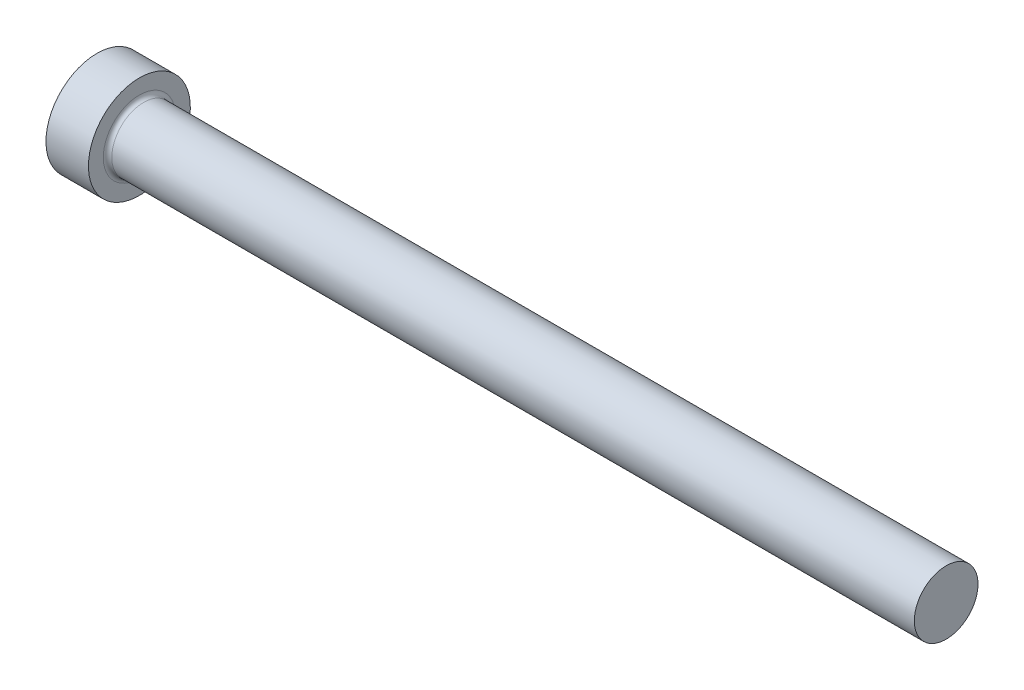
ISO-10303-21;
HEADER;
FILE_DESCRIPTION(('STEP AP214'),'2;1');
FILE_NAME('part.step','',(''),(''),'','','');
FILE_SCHEMA(('AUTOMOTIVE_DESIGN { 1 0 10303 214 1 1 1 1 }'));
ENDSEC;
DATA;
#1=APPLICATION_CONTEXT('core data for automotive mechanical design processes');
#2=APPLICATION_PROTOCOL_DEFINITION('international standard','automotive_design',2000,#1);
#3=PRODUCT_CONTEXT('',#1,'mechanical');
#4=PRODUCT('Part','Part','',(#3));
#5=PRODUCT_RELATED_PRODUCT_CATEGORY('part','',(#4));
#6=PRODUCT_DEFINITION_FORMATION('','',#4);
#7=PRODUCT_DEFINITION_CONTEXT('part definition',#1,'design');
#8=PRODUCT_DEFINITION('design','',#6,#7);
#9=PRODUCT_DEFINITION_SHAPE('','',#8);
#10=(LENGTH_UNIT() NAMED_UNIT(*) SI_UNIT(.MILLI.,.METRE.));
#11=(NAMED_UNIT(*) PLANE_ANGLE_UNIT() SI_UNIT($,.RADIAN.));
#12=(NAMED_UNIT(*) SI_UNIT($,.STERADIAN.) SOLID_ANGLE_UNIT());
#13=UNCERTAINTY_MEASURE_WITH_UNIT(LENGTH_MEASURE(1.E-05),#10,'distance_accuracy_value','');
#14=(GEOMETRIC_REPRESENTATION_CONTEXT(3) GLOBAL_UNCERTAINTY_ASSIGNED_CONTEXT((#13)) GLOBAL_UNIT_ASSIGNED_CONTEXT((#10,
#11,#12)) REPRESENTATION_CONTEXT('',''));
#15=CARTESIAN_POINT('',(0.,0.,0.));
#16=DIRECTION('',(0.,0.,1.));
#17=DIRECTION('',(1.,0.,0.));
#18=AXIS2_PLACEMENT_3D('',#15,#16,#17);
#19=CARTESIAN_POINT('',(0.,0.,0.));
#20=DIRECTION('',(-1.,0.,0.));
#21=DIRECTION('',(0.,-1.,0.));
#22=AXIS2_PLACEMENT_3D('',#19,#20,#21);
#23=PLANE('',#22);
#24=CARTESIAN_POINT('',(0.,0.,0.));
#25=DIRECTION('',(1.,0.,0.));
#26=DIRECTION('',(0.,1.,0.));
#27=AXIS2_PLACEMENT_3D('',#24,#25,#26);
#28=CIRCLE('',#27,6.);
#29=CARTESIAN_POINT('',(0.,6.,0.));
#30=VERTEX_POINT('',#29);
#31=EDGE_CURVE('E25',#30,#30,#28,.T.);
#32=ORIENTED_EDGE('',*,*,#31,.F.);
#33=EDGE_LOOP('',(#32));
#34=FACE_BOUND('',#33,.T.);
#35=ADVANCED_FACE('F14',(#34),#23,.T.);
#36=CARTESIAN_POINT('',(100.,0.,0.));
#37=DIRECTION('',(1.,0.,0.));
#38=DIRECTION('',(0.,1.,0.));
#39=AXIS2_PLACEMENT_3D('',#36,#37,#38);
#40=CYLINDRICAL_SURFACE('',#39,6.);
#41=ORIENTED_EDGE('',*,*,#31,.T.);
#42=EDGE_LOOP('',(#41));
#43=FACE_BOUND('',#42,.T.);
#44=CARTESIAN_POINT('',(5.,0.,0.));
#45=DIRECTION('',(1.,0.,0.));
#46=DIRECTION('',(0.,1.,0.));
#47=AXIS2_PLACEMENT_3D('',#44,#45,#46);
#48=CIRCLE('',#47,6.);
#49=CARTESIAN_POINT('',(5.00000000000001,6.,0.));
#50=VERTEX_POINT('',#49);
#51=EDGE_CURVE('E29',#50,#50,#48,.T.);
#52=ORIENTED_EDGE('',*,*,#51,.F.);
#53=EDGE_LOOP('',(#52));
#54=FACE_BOUND('',#53,.T.);
#55=ADVANCED_FACE('F51',(#43,#54),#40,.T.);
#56=CARTESIAN_POINT('',(5.,6.,0.));
#57=DIRECTION('',(1.,0.,0.));
#58=DIRECTION('',(0.,1.,0.));
#59=AXIS2_PLACEMENT_3D('',#56,#57,#58);
#60=PLANE('',#59);
#61=CARTESIAN_POINT('',(5.,0.,0.));
#62=DIRECTION('',(1.,0.,0.));
#63=DIRECTION('',(0.,1.,0.));
#64=AXIS2_PLACEMENT_3D('',#61,#62,#63);
#65=CIRCLE('',#64,4.24999999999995);
#66=CARTESIAN_POINT('',(5.,4.24999999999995,0.));
#67=VERTEX_POINT('',#66);
#68=EDGE_CURVE('E9',#67,#67,#65,.F.);
#69=ORIENTED_EDGE('',*,*,#68,.T.);
#70=EDGE_LOOP('',(#69));
#71=FACE_BOUND('',#70,.T.);
#72=ORIENTED_EDGE('',*,*,#51,.T.);
#73=EDGE_LOOP('',(#72));
#74=FACE_BOUND('',#73,.T.);
#75=ADVANCED_FACE('F42',(#71,#74),#60,.T.);
#76=CARTESIAN_POINT('',(100.,0.,0.));
#77=DIRECTION('',(1.,0.,0.));
#78=DIRECTION('',(0.,1.,0.));
#79=AXIS2_PLACEMENT_3D('',#76,#77,#78);
#80=CYLINDRICAL_SURFACE('',#79,3.74999999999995);
#81=CARTESIAN_POINT('',(5.5,0.,0.));
#82=DIRECTION('',(1.,0.,0.));
#83=DIRECTION('',(0.,1.,0.));
#84=AXIS2_PLACEMENT_3D('',#81,#82,#83);
#85=CIRCLE('',#84,3.74999999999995);
#86=CARTESIAN_POINT('',(5.5,3.74999999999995,0.));
#87=VERTEX_POINT('',#86);
#88=EDGE_CURVE('E21',#87,#87,#85,.T.);
#89=ORIENTED_EDGE('',*,*,#88,.T.);
#90=EDGE_LOOP('',(#89));
#91=FACE_BOUND('',#90,.T.);
#92=CARTESIAN_POINT('',(100.,0.,0.));
#93=DIRECTION('',(1.,0.,0.));
#94=DIRECTION('',(0.,1.,0.));
#95=AXIS2_PLACEMENT_3D('',#92,#93,#94);
#96=CIRCLE('',#95,3.75);
#97=CARTESIAN_POINT('',(100.,3.74999999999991,0.));
#98=VERTEX_POINT('',#97);
#99=EDGE_CURVE('E34',#98,#98,#96,.T.);
#100=ORIENTED_EDGE('',*,*,#99,.F.);
#101=EDGE_LOOP('',(#100));
#102=FACE_BOUND('',#101,.T.);
#103=ADVANCED_FACE('F40',(#91,#102),#80,.T.);
#104=CARTESIAN_POINT('',(100.,3.7499999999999,0.));
#105=DIRECTION('',(1.,0.,0.));
#106=DIRECTION('',(0.,1.,0.));
#107=AXIS2_PLACEMENT_3D('',#104,#105,#106);
#108=PLANE('',#107);
#109=ORIENTED_EDGE('',*,*,#99,.T.);
#110=EDGE_LOOP('',(#109));
#111=FACE_BOUND('',#110,.T.);
#112=ADVANCED_FACE('F38',(#111),#108,.T.);
#113=CARTESIAN_POINT('',(5.5,0.,0.));
#114=DIRECTION('',(1.,0.,0.));
#115=DIRECTION('',(0.,1.,0.));
#116=AXIS2_PLACEMENT_3D('',#113,#114,#115);
#117=TOROIDAL_SURFACE('',#116,4.24999999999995,0.5);
#118=ORIENTED_EDGE('',*,*,#68,.F.);
#119=EDGE_LOOP('',(#118));
#120=FACE_BOUND('',#119,.T.);
#121=ORIENTED_EDGE('',*,*,#88,.F.);
#122=EDGE_LOOP('',(#121));
#123=FACE_BOUND('',#122,.T.);
#124=ADVANCED_FACE('F16',(#120,#123),#117,.F.);
#125=CLOSED_SHELL('',(#35,#55,#75,#103,#112,#124));
#126=MANIFOLD_SOLID_BREP('B1',#125);
#127=ADVANCED_BREP_SHAPE_REPRESENTATION('',(#18,#126),#14);
#128=SHAPE_DEFINITION_REPRESENTATION(#9,#127);
ENDSEC;
END-ISO-10303-21;
